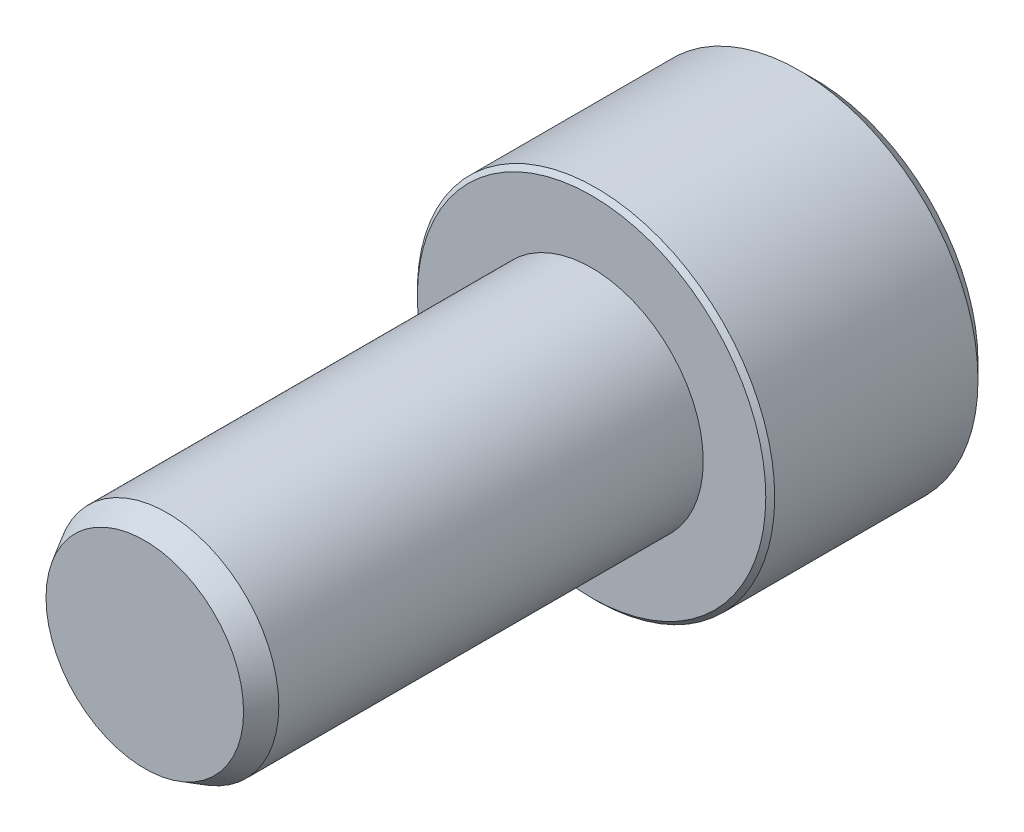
ISO-10303-21;
HEADER;
FILE_DESCRIPTION(('STEP AP214'),'2;1');
FILE_NAME('part.step','',(''),(''),'','','');
FILE_SCHEMA(('AUTOMOTIVE_DESIGN { 1 0 10303 214 1 1 1 1 }'));
ENDSEC;
DATA;
#1=APPLICATION_CONTEXT('core data for automotive mechanical design processes');
#2=APPLICATION_PROTOCOL_DEFINITION('international standard','automotive_design',2000,#1);
#3=PRODUCT_CONTEXT('',#1,'mechanical');
#4=PRODUCT('Part','Part','',(#3));
#5=PRODUCT_RELATED_PRODUCT_CATEGORY('part','',(#4));
#6=PRODUCT_DEFINITION_FORMATION('','',#4);
#7=PRODUCT_DEFINITION_CONTEXT('part definition',#1,'design');
#8=PRODUCT_DEFINITION('design','',#6,#7);
#9=PRODUCT_DEFINITION_SHAPE('','',#8);
#10=(LENGTH_UNIT() NAMED_UNIT(*) SI_UNIT(.MILLI.,.METRE.));
#11=(NAMED_UNIT(*) PLANE_ANGLE_UNIT() SI_UNIT($,.RADIAN.));
#12=(NAMED_UNIT(*) SI_UNIT($,.STERADIAN.) SOLID_ANGLE_UNIT());
#13=UNCERTAINTY_MEASURE_WITH_UNIT(LENGTH_MEASURE(1.E-05),#10,'distance_accuracy_value','');
#14=(GEOMETRIC_REPRESENTATION_CONTEXT(3) GLOBAL_UNCERTAINTY_ASSIGNED_CONTEXT((#13)) GLOBAL_UNIT_ASSIGNED_CONTEXT((#10,
#11,#12)) REPRESENTATION_CONTEXT('',''));
#15=CARTESIAN_POINT('',(0.,0.,0.));
#16=DIRECTION('',(0.,0.,1.));
#17=DIRECTION('',(1.,0.,0.));
#18=AXIS2_PLACEMENT_3D('',#15,#16,#17);
#19=CARTESIAN_POINT('',(0.,0.,-10.));
#20=DIRECTION('',(0.,0.,1.));
#21=DIRECTION('',(1.,0.,0.));
#22=AXIS2_PLACEMENT_3D('',#19,#20,#21);
#23=PLANE('',#22);
#24=CARTESIAN_POINT('',(0.,0.,-10.));
#25=DIRECTION('',(0.,0.,1.));
#26=DIRECTION('',(1.,0.,0.));
#27=AXIS2_PLACEMENT_3D('',#24,#25,#26);
#28=CIRCLE('',#27,7.3);
#29=CARTESIAN_POINT('',(7.3,0.,-10.));
#30=VERTEX_POINT('',#29);
#31=EDGE_CURVE('E140',#30,#30,#28,.F.);
#32=ORIENTED_EDGE('',*,*,#31,.T.);
#33=EDGE_LOOP('',(#32));
#34=FACE_BOUND('',#33,.T.);
#35=DIRECTION('',(-0.5,-0.866025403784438,0.));
#36=VECTOR('',#35,1.);
#37=CARTESIAN_POINT('',(-2.3094010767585,4.,-10.));
#38=LINE('',#37,#36);
#39=CARTESIAN_POINT('',(-2.3094010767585,4.,-10.));
#40=VERTEX_POINT('',#39);
#41=CARTESIAN_POINT('',(-4.61880215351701,0.,-10.));
#42=VERTEX_POINT('',#41);
#43=EDGE_CURVE('E47',#40,#42,#38,.T.);
#44=ORIENTED_EDGE('',*,*,#43,.T.);
#45=DIRECTION('',(0.5,-0.866025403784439,0.));
#46=VECTOR('',#45,1.);
#47=CARTESIAN_POINT('',(-4.61880215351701,0.,-10.));
#48=LINE('',#47,#46);
#49=CARTESIAN_POINT('',(-2.3094010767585,-4.,-10.));
#50=VERTEX_POINT('',#49);
#51=EDGE_CURVE('E87',#42,#50,#48,.T.);
#52=ORIENTED_EDGE('',*,*,#51,.T.);
#53=DIRECTION('',(1.,0.,0.));
#54=VECTOR('',#53,1.);
#55=CARTESIAN_POINT('',(-2.3094010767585,-4.,-10.));
#56=LINE('',#55,#54);
#57=CARTESIAN_POINT('',(2.30940107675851,-4.,-10.));
#58=VERTEX_POINT('',#57);
#59=EDGE_CURVE('E95',#50,#58,#56,.T.);
#60=ORIENTED_EDGE('',*,*,#59,.T.);
#61=DIRECTION('',(0.5,0.866025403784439,0.));
#62=VECTOR('',#61,1.);
#63=CARTESIAN_POINT('',(2.30940107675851,-4.,-10.));
#64=LINE('',#63,#62);
#65=CARTESIAN_POINT('',(4.61880215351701,0.,-10.));
#66=VERTEX_POINT('',#65);
#67=EDGE_CURVE('E110',#58,#66,#64,.T.);
#68=ORIENTED_EDGE('',*,*,#67,.T.);
#69=DIRECTION('',(-0.5,0.866025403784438,0.));
#70=VECTOR('',#69,1.);
#71=CARTESIAN_POINT('',(2.3094010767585,4.,-10.));
#72=LINE('',#71,#70);
#73=CARTESIAN_POINT('',(2.3094010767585,4.,-10.));
#74=VERTEX_POINT('',#73);
#75=EDGE_CURVE('E113',#66,#74,#72,.T.);
#76=ORIENTED_EDGE('',*,*,#75,.T.);
#77=DIRECTION('',(-1.,0.,0.));
#78=VECTOR('',#77,1.);
#79=CARTESIAN_POINT('',(-2.3094010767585,4.,-10.));
#80=LINE('',#79,#78);
#81=EDGE_CURVE('E106',#74,#40,#80,.T.);
#82=ORIENTED_EDGE('',*,*,#81,.T.);
#83=EDGE_LOOP('',(#44,#52,#60,#68,#76,#82));
#84=FACE_BOUND('',#83,.T.);
#85=ADVANCED_FACE('F32',(#34,#84),#23,.F.);
#86=CARTESIAN_POINT('',(0.,0.,20.));
#87=DIRECTION('',(0.,0.,-1.));
#88=DIRECTION('',(-1.,0.,0.));
#89=AXIS2_PLACEMENT_3D('',#86,#87,#88);
#90=CYLINDRICAL_SURFACE('',#89,5.);
#91=CARTESIAN_POINT('',(0.,0.,19.));
#92=DIRECTION('',(0.,0.,1.));
#93=DIRECTION('',(1.,0.,0.));
#94=AXIS2_PLACEMENT_3D('',#91,#92,#93);
#95=CIRCLE('',#94,5.);
#96=CARTESIAN_POINT('',(5.,0.,19.));
#97=VERTEX_POINT('',#96);
#98=EDGE_CURVE('E146',#97,#97,#95,.F.);
#99=ORIENTED_EDGE('',*,*,#98,.T.);
#100=EDGE_LOOP('',(#99));
#101=FACE_BOUND('',#100,.T.);
#102=CARTESIAN_POINT('',(0.,0.,0.));
#103=DIRECTION('',(0.,0.,1.));
#104=DIRECTION('',(1.,0.,0.));
#105=AXIS2_PLACEMENT_3D('',#102,#103,#104);
#106=CIRCLE('',#105,5.);
#107=CARTESIAN_POINT('',(5.,0.,0.));
#108=VERTEX_POINT('',#107);
#109=EDGE_CURVE('E101',#108,#108,#106,.T.);
#110=ORIENTED_EDGE('',*,*,#109,.T.);
#111=EDGE_LOOP('',(#110));
#112=FACE_BOUND('',#111,.T.);
#113=ADVANCED_FACE('F34',(#101,#112),#90,.T.);
#114=CARTESIAN_POINT('',(0.,0.,20.));
#115=DIRECTION('',(0.,0.,1.));
#116=DIRECTION('',(1.,0.,0.));
#117=AXIS2_PLACEMENT_3D('',#114,#115,#116);
#118=PLANE('',#117);
#119=CARTESIAN_POINT('',(0.,0.,20.));
#120=DIRECTION('',(0.,0.,1.));
#121=DIRECTION('',(1.,0.,0.));
#122=AXIS2_PLACEMENT_3D('',#119,#120,#121);
#123=CIRCLE('',#122,4.42264973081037);
#124=CARTESIAN_POINT('',(4.42264973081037,0.,20.));
#125=VERTEX_POINT('',#124);
#126=EDGE_CURVE('E143',#125,#125,#123,.T.);
#127=ORIENTED_EDGE('',*,*,#126,.T.);
#128=EDGE_LOOP('',(#127));
#129=FACE_BOUND('',#128,.T.);
#130=ADVANCED_FACE('F172',(#129),#118,.T.);
#131=CARTESIAN_POINT('',(0.,0.,0.));
#132=DIRECTION('',(0.,0.,1.));
#133=DIRECTION('',(1.,0.,0.));
#134=AXIS2_PLACEMENT_3D('',#131,#132,#133);
#135=PLANE('',#134);
#136=CARTESIAN_POINT('',(0.,0.,0.));
#137=DIRECTION('',(0.,0.,1.));
#138=DIRECTION('',(1.,0.,0.));
#139=AXIS2_PLACEMENT_3D('',#136,#137,#138);
#140=CIRCLE('',#139,7.8);
#141=CARTESIAN_POINT('',(7.8,0.,0.));
#142=VERTEX_POINT('',#141);
#143=EDGE_CURVE('E40',#142,#142,#140,.T.);
#144=ORIENTED_EDGE('',*,*,#143,.T.);
#145=EDGE_LOOP('',(#144));
#146=FACE_BOUND('',#145,.T.);
#147=ORIENTED_EDGE('',*,*,#109,.F.);
#148=EDGE_LOOP('',(#147));
#149=FACE_BOUND('',#148,.T.);
#150=ADVANCED_FACE('F151',(#146,#149),#135,.T.);
#151=CARTESIAN_POINT('',(0.,0.,-10.));
#152=DIRECTION('',(0.,0.,1.));
#153=DIRECTION('',(1.,0.,0.));
#154=AXIS2_PLACEMENT_3D('',#151,#152,#153);
#155=CYLINDRICAL_SURFACE('',#154,8.);
#156=CARTESIAN_POINT('',(0.,0.,-0.200000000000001));
#157=DIRECTION('',(0.,0.,1.));
#158=DIRECTION('',(1.,0.,0.));
#159=AXIS2_PLACEMENT_3D('',#156,#157,#158);
#160=CIRCLE('',#159,8.);
#161=CARTESIAN_POINT('',(8.,0.,-0.200000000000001));
#162=VERTEX_POINT('',#161);
#163=EDGE_CURVE('E11',#162,#162,#160,.F.);
#164=ORIENTED_EDGE('',*,*,#163,.T.);
#165=EDGE_LOOP('',(#164));
#166=FACE_BOUND('',#165,.T.);
#167=CARTESIAN_POINT('',(0.,0.,-9.3));
#168=DIRECTION('',(0.,0.,1.));
#169=DIRECTION('',(1.,0.,0.));
#170=AXIS2_PLACEMENT_3D('',#167,#168,#169);
#171=CIRCLE('',#170,8.);
#172=CARTESIAN_POINT('',(8.,0.,-9.3));
#173=VERTEX_POINT('',#172);
#174=EDGE_CURVE('E137',#173,#173,#171,.T.);
#175=ORIENTED_EDGE('',*,*,#174,.T.);
#176=EDGE_LOOP('',(#175));
#177=FACE_BOUND('',#176,.T.);
#178=ADVANCED_FACE('F177',(#166,#177),#155,.T.);
#179=CARTESIAN_POINT('',(-2.3094010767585,4.,-4.5));
#180=DIRECTION('',(0.866025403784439,-0.5,0.));
#181=DIRECTION('',(0.5,0.866025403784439,0.));
#182=AXIS2_PLACEMENT_3D('',#179,#180,#181);
#183=PLANE('',#182);
#184=ORIENTED_EDGE('',*,*,#43,.F.);
#185=DIRECTION('',(0.,0.,-1.));
#186=VECTOR('',#185,1.);
#187=CARTESIAN_POINT('',(-2.3094010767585,4.,-4.5));
#188=LINE('',#187,#186);
#189=CARTESIAN_POINT('',(-2.3094010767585,4.,-4.5));
#190=VERTEX_POINT('',#189);
#191=EDGE_CURVE('E126',#190,#40,#188,.T.);
#192=ORIENTED_EDGE('',*,*,#191,.F.);
#193=DIRECTION('',(-0.5,-0.866025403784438,0.));
#194=VECTOR('',#193,1.);
#195=CARTESIAN_POINT('',(-2.3094010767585,4.,-4.5));
#196=LINE('',#195,#194);
#197=CARTESIAN_POINT('',(-4.61880215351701,0.,-4.5));
#198=VERTEX_POINT('',#197);
#199=EDGE_CURVE('E100',#190,#198,#196,.T.);
#200=ORIENTED_EDGE('',*,*,#199,.T.);
#201=DIRECTION('',(0.,0.,-1.));
#202=VECTOR('',#201,1.);
#203=CARTESIAN_POINT('',(-4.61880215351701,0.,-4.5));
#204=LINE('',#203,#202);
#205=EDGE_CURVE('E89',#198,#42,#204,.T.);
#206=ORIENTED_EDGE('',*,*,#205,.T.);
#207=EDGE_LOOP('',(#184,#192,#200,#206));
#208=FACE_BOUND('',#207,.T.);
#209=ADVANCED_FACE('F98',(#208),#183,.T.);
#210=CARTESIAN_POINT('',(-4.61880215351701,0.,-4.5));
#211=DIRECTION('',(0.866025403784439,0.5,0.));
#212=DIRECTION('',(-0.5,0.866025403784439,0.));
#213=AXIS2_PLACEMENT_3D('',#210,#211,#212);
#214=PLANE('',#213);
#215=ORIENTED_EDGE('',*,*,#51,.F.);
#216=ORIENTED_EDGE('',*,*,#205,.F.);
#217=DIRECTION('',(0.5,-0.866025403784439,0.));
#218=VECTOR('',#217,1.);
#219=CARTESIAN_POINT('',(-4.61880215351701,0.,-4.5));
#220=LINE('',#219,#218);
#221=CARTESIAN_POINT('',(-2.3094010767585,-4.,-4.5));
#222=VERTEX_POINT('',#221);
#223=EDGE_CURVE('E117',#198,#222,#220,.T.);
#224=ORIENTED_EDGE('',*,*,#223,.T.);
#225=DIRECTION('',(0.,0.,-1.));
#226=VECTOR('',#225,1.);
#227=CARTESIAN_POINT('',(-2.3094010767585,-4.,-4.5));
#228=LINE('',#227,#226);
#229=EDGE_CURVE('E91',#222,#50,#228,.T.);
#230=ORIENTED_EDGE('',*,*,#229,.T.);
#231=EDGE_LOOP('',(#215,#216,#224,#230));
#232=FACE_BOUND('',#231,.T.);
#233=ADVANCED_FACE('F88',(#232),#214,.T.);
#234=CARTESIAN_POINT('',(-2.3094010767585,-4.,-4.5));
#235=DIRECTION('',(0.,1.,0.));
#236=DIRECTION('',(0.,0.,1.));
#237=AXIS2_PLACEMENT_3D('',#234,#235,#236);
#238=PLANE('',#237);
#239=ORIENTED_EDGE('',*,*,#59,.F.);
#240=ORIENTED_EDGE('',*,*,#229,.F.);
#241=DIRECTION('',(1.,0.,0.));
#242=VECTOR('',#241,1.);
#243=CARTESIAN_POINT('',(-2.3094010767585,-4.,-4.5));
#244=LINE('',#243,#242);
#245=CARTESIAN_POINT('',(2.30940107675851,-4.,-4.5));
#246=VERTEX_POINT('',#245);
#247=EDGE_CURVE('E119',#222,#246,#244,.T.);
#248=ORIENTED_EDGE('',*,*,#247,.T.);
#249=DIRECTION('',(0.,0.,-1.));
#250=VECTOR('',#249,1.);
#251=CARTESIAN_POINT('',(2.30940107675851,-4.,-4.5));
#252=LINE('',#251,#250);
#253=EDGE_CURVE('E132',#246,#58,#252,.T.);
#254=ORIENTED_EDGE('',*,*,#253,.T.);
#255=EDGE_LOOP('',(#239,#240,#248,#254));
#256=FACE_BOUND('',#255,.T.);
#257=ADVANCED_FACE('F205',(#256),#238,.T.);
#258=CARTESIAN_POINT('',(2.30940107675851,-4.,-4.5));
#259=DIRECTION('',(-0.866025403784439,0.5,0.));
#260=DIRECTION('',(-0.5,-0.866025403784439,0.));
#261=AXIS2_PLACEMENT_3D('',#258,#259,#260);
#262=PLANE('',#261);
#263=ORIENTED_EDGE('',*,*,#67,.F.);
#264=ORIENTED_EDGE('',*,*,#253,.F.);
#265=DIRECTION('',(0.5,0.866025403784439,0.));
#266=VECTOR('',#265,1.);
#267=CARTESIAN_POINT('',(2.30940107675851,-4.,-4.5));
#268=LINE('',#267,#266);
#269=CARTESIAN_POINT('',(4.61880215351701,0.,-4.5));
#270=VERTEX_POINT('',#269);
#271=EDGE_CURVE('E121',#246,#270,#268,.T.);
#272=ORIENTED_EDGE('',*,*,#271,.T.);
#273=DIRECTION('',(0.,0.,-1.));
#274=VECTOR('',#273,1.);
#275=CARTESIAN_POINT('',(4.61880215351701,0.,-4.5));
#276=LINE('',#275,#274);
#277=EDGE_CURVE('E130',#270,#66,#276,.T.);
#278=ORIENTED_EDGE('',*,*,#277,.T.);
#279=EDGE_LOOP('',(#263,#264,#272,#278));
#280=FACE_BOUND('',#279,.T.);
#281=ADVANCED_FACE('F212',(#280),#262,.T.);
#282=CARTESIAN_POINT('',(2.3094010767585,4.,-4.5));
#283=DIRECTION('',(-0.866025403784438,-0.5,0.));
#284=DIRECTION('',(0.5,-0.866025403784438,0.));
#285=AXIS2_PLACEMENT_3D('',#282,#283,#284);
#286=PLANE('',#285);
#287=ORIENTED_EDGE('',*,*,#75,.F.);
#288=ORIENTED_EDGE('',*,*,#277,.F.);
#289=DIRECTION('',(-0.5,0.866025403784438,0.));
#290=VECTOR('',#289,1.);
#291=CARTESIAN_POINT('',(2.3094010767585,4.,-4.5));
#292=LINE('',#291,#290);
#293=CARTESIAN_POINT('',(2.3094010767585,4.,-4.5));
#294=VERTEX_POINT('',#293);
#295=EDGE_CURVE('E123',#270,#294,#292,.T.);
#296=ORIENTED_EDGE('',*,*,#295,.T.);
#297=DIRECTION('',(0.,0.,-1.));
#298=VECTOR('',#297,1.);
#299=CARTESIAN_POINT('',(2.3094010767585,4.,-4.5));
#300=LINE('',#299,#298);
#301=EDGE_CURVE('E128',#294,#74,#300,.T.);
#302=ORIENTED_EDGE('',*,*,#301,.T.);
#303=EDGE_LOOP('',(#287,#288,#296,#302));
#304=FACE_BOUND('',#303,.T.);
#305=ADVANCED_FACE('F220',(#304),#286,.T.);
#306=CARTESIAN_POINT('',(-2.3094010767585,4.,-4.5));
#307=DIRECTION('',(0.,-1.,0.));
#308=DIRECTION('',(0.,0.,-1.));
#309=AXIS2_PLACEMENT_3D('',#306,#307,#308);
#310=PLANE('',#309);
#311=ORIENTED_EDGE('',*,*,#81,.F.);
#312=ORIENTED_EDGE('',*,*,#301,.F.);
#313=DIRECTION('',(-1.,0.,0.));
#314=VECTOR('',#313,1.);
#315=CARTESIAN_POINT('',(-2.3094010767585,4.,-4.5));
#316=LINE('',#315,#314);
#317=EDGE_CURVE('E54',#294,#190,#316,.T.);
#318=ORIENTED_EDGE('',*,*,#317,.T.);
#319=ORIENTED_EDGE('',*,*,#191,.T.);
#320=EDGE_LOOP('',(#311,#312,#318,#319));
#321=FACE_BOUND('',#320,.T.);
#322=ADVANCED_FACE('F228',(#321),#310,.T.);
#323=CARTESIAN_POINT('',(0.,8.,-4.5));
#324=DIRECTION('',(0.,0.,1.));
#325=DIRECTION('',(1.,0.,0.));
#326=AXIS2_PLACEMENT_3D('',#323,#324,#325);
#327=PLANE('',#326);
#328=ORIENTED_EDGE('',*,*,#199,.F.);
#329=ORIENTED_EDGE('',*,*,#317,.F.);
#330=ORIENTED_EDGE('',*,*,#295,.F.);
#331=ORIENTED_EDGE('',*,*,#271,.F.);
#332=ORIENTED_EDGE('',*,*,#247,.F.);
#333=ORIENTED_EDGE('',*,*,#223,.F.);
#334=EDGE_LOOP('',(#328,#329,#330,#331,#332,#333));
#335=FACE_BOUND('',#334,.T.);
#336=ADVANCED_FACE('F236',(#335),#327,.F.);
#337=CARTESIAN_POINT('',(0.,0.,-9.3));
#338=DIRECTION('',(0.,0.,1.));
#339=DIRECTION('',(1.,0.,0.));
#340=AXIS2_PLACEMENT_3D('',#337,#338,#339);
#341=CONICAL_SURFACE('',#340,8.,0.785398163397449);
#342=ORIENTED_EDGE('',*,*,#31,.F.);
#343=EDGE_LOOP('',(#342));
#344=FACE_BOUND('',#343,.T.);
#345=ORIENTED_EDGE('',*,*,#174,.F.);
#346=EDGE_LOOP('',(#345));
#347=FACE_BOUND('',#346,.T.);
#348=ADVANCED_FACE('F162',(#344,#347),#341,.T.);
#349=CARTESIAN_POINT('',(0.,0.,20.));
#350=DIRECTION('',(0.,0.,-1.));
#351=DIRECTION('',(-1.,0.,0.));
#352=AXIS2_PLACEMENT_3D('',#349,#350,#351);
#353=CONICAL_SURFACE('',#352,4.42264973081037,0.523598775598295);
#354=ORIENTED_EDGE('',*,*,#98,.F.);
#355=EDGE_LOOP('',(#354));
#356=FACE_BOUND('',#355,.T.);
#357=ORIENTED_EDGE('',*,*,#126,.F.);
#358=EDGE_LOOP('',(#357));
#359=FACE_BOUND('',#358,.T.);
#360=ADVANCED_FACE('F156',(#356,#359),#353,.T.);
#361=CARTESIAN_POINT('',(0.,0.,0.));
#362=DIRECTION('',(0.,0.,-1.));
#363=DIRECTION('',(-1.,0.,0.));
#364=AXIS2_PLACEMENT_3D('',#361,#362,#363);
#365=CONICAL_SURFACE('',#364,7.8,0.785398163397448);
#366=ORIENTED_EDGE('',*,*,#163,.F.);
#367=EDGE_LOOP('',(#366));
#368=FACE_BOUND('',#367,.T.);
#369=ORIENTED_EDGE('',*,*,#143,.F.);
#370=EDGE_LOOP('',(#369));
#371=FACE_BOUND('',#370,.T.);
#372=ADVANCED_FACE('F154',(#368,#371),#365,.T.);
#373=CLOSED_SHELL('',(#85,#113,#130,#150,#178,#209,#233,#257,#281,#305,#322,#336,#348,#360,#372));
#374=MANIFOLD_SOLID_BREP('B2',#373);
#375=ADVANCED_BREP_SHAPE_REPRESENTATION('',(#18,#374),#14);
#376=SHAPE_DEFINITION_REPRESENTATION(#9,#375);
ENDSEC;
END-ISO-10303-21;
